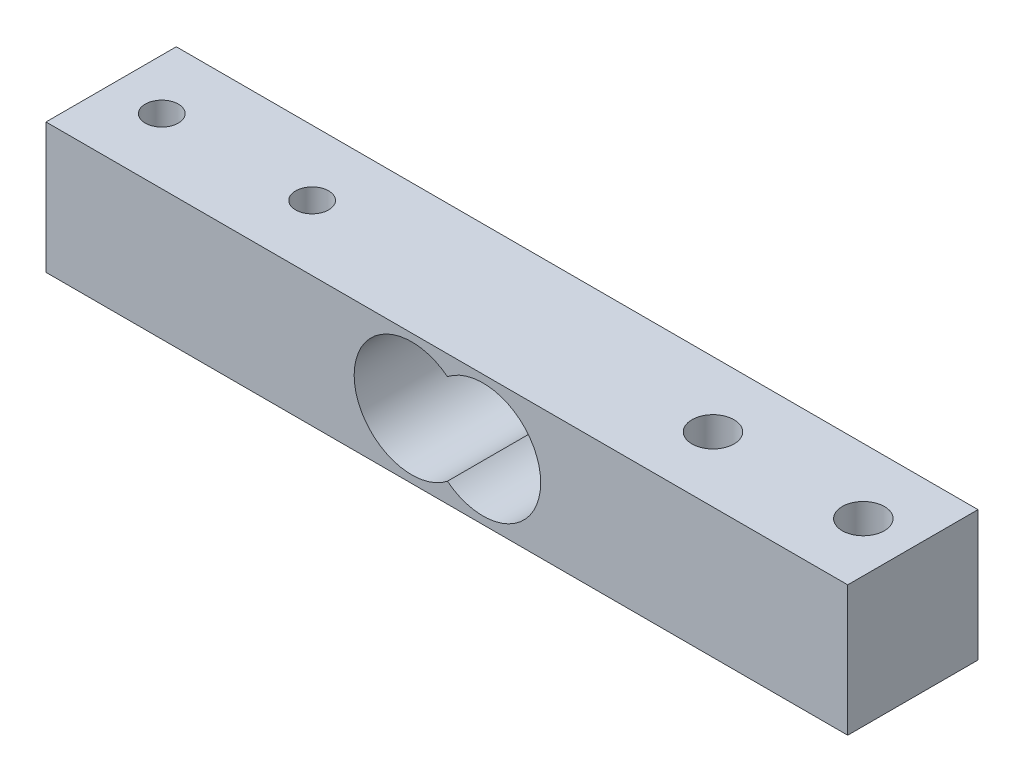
from build123d import *

# Parameters (mm, degrees)
SKETCH1_W                 = 80
SKETCH1_H                 = 13
BOSS_EXTRUDE1_DEPTH       = 13
M5X0_8_TAPPED_HOLE2_D     = 4.2
M5X0_8_TAPPED_HOLE2_DEPTH = 13.97
M5X0_8_TAPPED_HOLE2_TIP   = 1.2618073
M4X0_7_TAPPED_HOLE2_D     = 3.3


with BuildPart() as part:
    # Sketch1 → Boss-Extrude1 (new body)
    with BuildSketch(Plane.XY):
        Rectangle(SKETCH1_W, SKETCH1_H)
        with BuildLine():
            ThreePointArc((0.056, 4.518557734), (-9.25, 0), (0.056, -4.518557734))
            ThreePointArc((0.056, -4.518557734), (9.362, 0), (0.056, 4.518557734))
        make_face(mode=Mode.SUBTRACT)
    extrude(amount=BOSS_EXTRUDE1_DEPTH)

    # M5x0.8 Tapped Hole2
    with Locations(Plane(origin=(0, 6.5, 0), x_dir=(1, 0, 0), z_dir=(0, 1, 0))):
        with Locations((20.056, -6.5), (35.056, -6.5)):
            Hole(M5X0_8_TAPPED_HOLE2_D / 2, depth=M5X0_8_TAPPED_HOLE2_DEPTH)
            with Locations((0, 0, -(M5X0_8_TAPPED_HOLE2_DEPTH + M5X0_8_TAPPED_HOLE2_TIP / 2))):  # 118° drill point
                Cone(0, M5X0_8_TAPPED_HOLE2_D / 2, M5X0_8_TAPPED_HOLE2_TIP, mode=Mode.SUBTRACT)

    # M4x0.7 Tapped Hole2 (through all)
    with Locations(Plane(origin=(0, 6.5, 0), x_dir=(1, 0, 0), z_dir=(0, 1, 0))):
        with Locations((-34.944, -6.5), (-19.944, -6.5)):
            Hole(M4X0_7_TAPPED_HOLE2_D / 2)


solid = part.part
